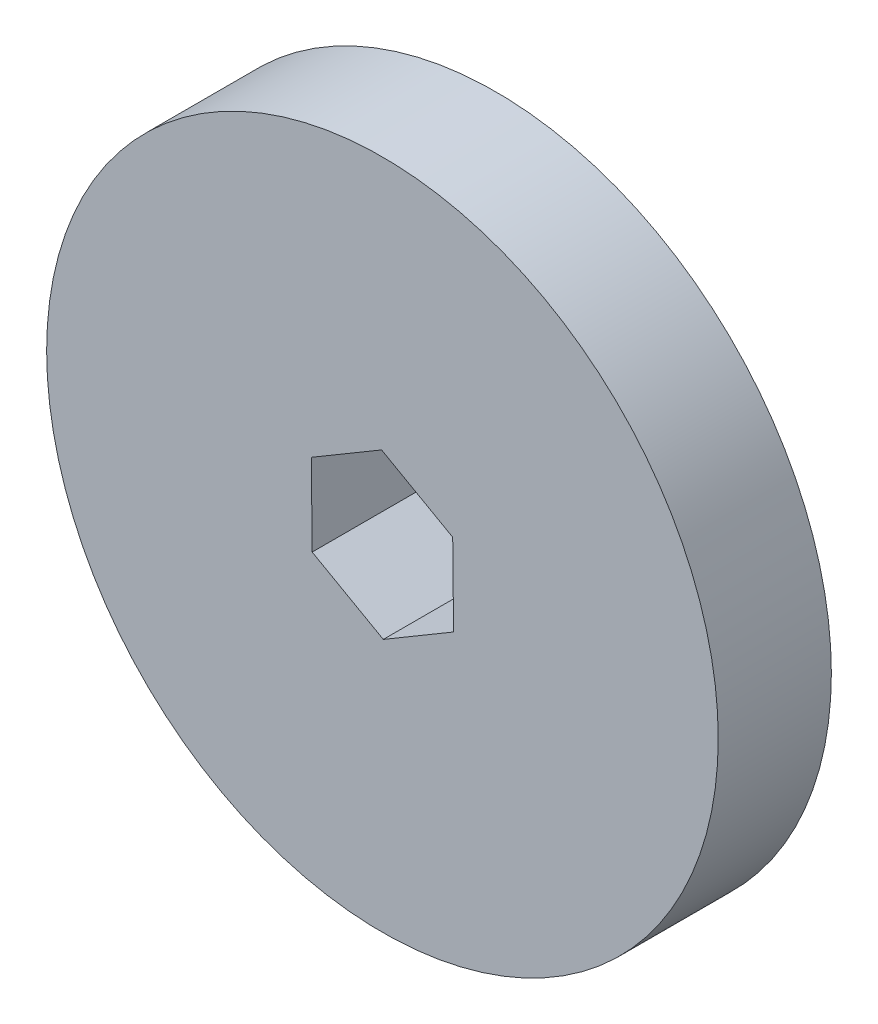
ISO-10303-21;
HEADER;
FILE_DESCRIPTION(('STEP AP214'),'2;1');
FILE_NAME('part.step','',(''),(''),'','','');
FILE_SCHEMA(('AUTOMOTIVE_DESIGN { 1 0 10303 214 1 1 1 1 }'));
ENDSEC;
DATA;
#1=APPLICATION_CONTEXT('core data for automotive mechanical design processes');
#2=APPLICATION_PROTOCOL_DEFINITION('international standard','automotive_design',2000,#1);
#3=PRODUCT_CONTEXT('',#1,'mechanical');
#4=PRODUCT('Part','Part','',(#3));
#5=PRODUCT_RELATED_PRODUCT_CATEGORY('part','',(#4));
#6=PRODUCT_DEFINITION_FORMATION('','',#4);
#7=PRODUCT_DEFINITION_CONTEXT('part definition',#1,'design');
#8=PRODUCT_DEFINITION('design','',#6,#7);
#9=PRODUCT_DEFINITION_SHAPE('','',#8);
#10=(LENGTH_UNIT() NAMED_UNIT(*) SI_UNIT(.MILLI.,.METRE.));
#11=(NAMED_UNIT(*) PLANE_ANGLE_UNIT() SI_UNIT($,.RADIAN.));
#12=(NAMED_UNIT(*) SI_UNIT($,.STERADIAN.) SOLID_ANGLE_UNIT());
#13=UNCERTAINTY_MEASURE_WITH_UNIT(LENGTH_MEASURE(1.E-05),#10,'distance_accuracy_value','');
#14=(GEOMETRIC_REPRESENTATION_CONTEXT(3) GLOBAL_UNCERTAINTY_ASSIGNED_CONTEXT((#13)) GLOBAL_UNIT_ASSIGNED_CONTEXT((#10,
#11,#12)) REPRESENTATION_CONTEXT('',''));
#15=CARTESIAN_POINT('',(0.,0.,0.));
#16=DIRECTION('',(0.,0.,1.));
#17=DIRECTION('',(1.,0.,0.));
#18=AXIS2_PLACEMENT_3D('',#15,#16,#17);
#19=CARTESIAN_POINT('',(0.,0.,10.16));
#20=DIRECTION('',(0.,0.,-1.));
#21=DIRECTION('',(-1.,0.,0.));
#22=AXIS2_PLACEMENT_3D('',#19,#20,#21);
#23=CYLINDRICAL_SURFACE('',#22,30.1625);
#24=CARTESIAN_POINT('',(0.,0.,10.16));
#25=DIRECTION('',(0.,0.,1.));
#26=DIRECTION('',(1.,0.,0.));
#27=AXIS2_PLACEMENT_3D('',#24,#25,#26);
#28=CIRCLE('',#27,30.1625);
#29=CARTESIAN_POINT('',(30.1625,0.,10.16));
#30=VERTEX_POINT('',#29);
#31=EDGE_CURVE('E11',#30,#30,#28,.T.);
#32=ORIENTED_EDGE('',*,*,#31,.F.);
#33=EDGE_LOOP('',(#32));
#34=FACE_BOUND('',#33,.T.);
#35=CARTESIAN_POINT('',(0.,0.,0.));
#36=DIRECTION('',(0.,0.,1.));
#37=DIRECTION('',(1.,0.,0.));
#38=AXIS2_PLACEMENT_3D('',#35,#36,#37);
#39=CIRCLE('',#38,30.1625);
#40=CARTESIAN_POINT('',(30.1625,0.,0.));
#41=VERTEX_POINT('',#40);
#42=EDGE_CURVE('E39',#41,#41,#39,.T.);
#43=ORIENTED_EDGE('',*,*,#42,.T.);
#44=EDGE_LOOP('',(#43));
#45=FACE_BOUND('',#44,.T.);
#46=ADVANCED_FACE('F36',(#34,#45),#23,.T.);
#47=CARTESIAN_POINT('',(0.,0.,10.16));
#48=DIRECTION('',(0.,0.,1.));
#49=DIRECTION('',(1.,0.,0.));
#50=AXIS2_PLACEMENT_3D('',#47,#48,#49);
#51=PLANE('',#50);
#52=DIRECTION('',(-0.0105495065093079,0.999944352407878,0.));
#53=VECTOR('',#52,1.);
#54=CARTESIAN_POINT('',(6.38832296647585,-3.59898082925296,10.16));
#55=LINE('',#54,#53);
#56=CARTESIAN_POINT('',(6.38832296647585,-3.59898082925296,10.16));
#57=VERTEX_POINT('',#56);
#58=CARTESIAN_POINT('',(6.31097030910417,3.73295956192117,10.16));
#59=VERTEX_POINT('',#58);
#60=EDGE_CURVE('E50',#57,#59,#55,.T.);
#61=ORIENTED_EDGE('',*,*,#60,.F.);
#62=DIRECTION('',(0.860702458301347,0.509108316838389,0.));
#63=VECTOR('',#62,1.);
#64=CARTESIAN_POINT('',(0.0773526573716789,-7.33194039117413,10.16));
#65=LINE('',#64,#63);
#66=CARTESIAN_POINT('',(0.0773526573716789,-7.33194039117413,10.16));
#67=VERTEX_POINT('',#66);
#68=EDGE_CURVE('E107',#67,#57,#65,.T.);
#69=ORIENTED_EDGE('',*,*,#68,.F.);
#70=DIRECTION('',(0.871251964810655,-0.490836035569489,0.));
#71=VECTOR('',#70,1.);
#72=CARTESIAN_POINT('',(-6.31097030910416,-3.73295956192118,10.16));
#73=LINE('',#72,#71);
#74=CARTESIAN_POINT('',(-6.31097030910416,-3.73295956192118,10.16));
#75=VERTEX_POINT('',#74);
#76=EDGE_CURVE('E110',#75,#67,#73,.T.);
#77=ORIENTED_EDGE('',*,*,#76,.F.);
#78=DIRECTION('',(0.0105495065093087,-0.999944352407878,0.));
#79=VECTOR('',#78,1.);
#80=CARTESIAN_POINT('',(-6.38832296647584,3.59898082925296,10.16));
#81=LINE('',#80,#79);
#82=CARTESIAN_POINT('',(-6.38832296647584,3.59898082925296,10.16));
#83=VERTEX_POINT('',#82);
#84=EDGE_CURVE('E126',#83,#75,#81,.T.);
#85=ORIENTED_EDGE('',*,*,#84,.F.);
#86=DIRECTION('',(-0.860702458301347,-0.509108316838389,0.));
#87=VECTOR('',#86,1.);
#88=CARTESIAN_POINT('',(-0.0773526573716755,7.33194039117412,10.16));
#89=LINE('',#88,#87);
#90=CARTESIAN_POINT('',(-0.0773526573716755,7.33194039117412,10.16));
#91=VERTEX_POINT('',#90);
#92=EDGE_CURVE('E123',#91,#83,#89,.T.);
#93=ORIENTED_EDGE('',*,*,#92,.F.);
#94=DIRECTION('',(-0.871251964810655,0.490836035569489,0.));
#95=VECTOR('',#94,1.);
#96=CARTESIAN_POINT('',(6.31097030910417,3.73295956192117,10.16));
#97=LINE('',#96,#95);
#98=EDGE_CURVE('E121',#59,#91,#97,.T.);
#99=ORIENTED_EDGE('',*,*,#98,.F.);
#100=EDGE_LOOP('',(#61,#69,#77,#85,#93,#99));
#101=FACE_BOUND('',#100,.T.);
#102=ORIENTED_EDGE('',*,*,#31,.T.);
#103=EDGE_LOOP('',(#102));
#104=FACE_BOUND('',#103,.T.);
#105=ADVANCED_FACE('F143',(#101,#104),#51,.T.);
#106=CARTESIAN_POINT('',(0.,0.,0.));
#107=DIRECTION('',(0.,0.,1.));
#108=DIRECTION('',(1.,0.,0.));
#109=AXIS2_PLACEMENT_3D('',#106,#107,#108);
#110=PLANE('',#109);
#111=DIRECTION('',(0.860702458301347,0.509108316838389,0.));
#112=VECTOR('',#111,1.);
#113=CARTESIAN_POINT('',(0.0773526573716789,-7.33194039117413,0.));
#114=LINE('',#113,#112);
#115=CARTESIAN_POINT('',(0.0773526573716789,-7.33194039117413,0.));
#116=VERTEX_POINT('',#115);
#117=CARTESIAN_POINT('',(6.38832296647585,-3.59898082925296,0.));
#118=VERTEX_POINT('',#117);
#119=EDGE_CURVE('E96',#116,#118,#114,.T.);
#120=ORIENTED_EDGE('',*,*,#119,.T.);
#121=DIRECTION('',(-0.0105495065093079,0.999944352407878,0.));
#122=VECTOR('',#121,1.);
#123=CARTESIAN_POINT('',(6.38832296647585,-3.59898082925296,0.));
#124=LINE('',#123,#122);
#125=CARTESIAN_POINT('',(6.31097030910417,3.73295956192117,0.));
#126=VERTEX_POINT('',#125);
#127=EDGE_CURVE('E90',#118,#126,#124,.T.);
#128=ORIENTED_EDGE('',*,*,#127,.T.);
#129=DIRECTION('',(-0.871251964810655,0.490836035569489,0.));
#130=VECTOR('',#129,1.);
#131=CARTESIAN_POINT('',(6.31097030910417,3.73295956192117,0.));
#132=LINE('',#131,#130);
#133=CARTESIAN_POINT('',(-0.0773526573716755,7.33194039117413,0.));
#134=VERTEX_POINT('',#133);
#135=EDGE_CURVE('E99',#126,#134,#132,.T.);
#136=ORIENTED_EDGE('',*,*,#135,.T.);
#137=DIRECTION('',(-0.860702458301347,-0.509108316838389,0.));
#138=VECTOR('',#137,1.);
#139=CARTESIAN_POINT('',(-0.0773526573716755,7.33194039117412,0.));
#140=LINE('',#139,#138);
#141=CARTESIAN_POINT('',(-6.38832296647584,3.59898082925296,0.));
#142=VERTEX_POINT('',#141);
#143=EDGE_CURVE('E58',#134,#142,#140,.T.);
#144=ORIENTED_EDGE('',*,*,#143,.T.);
#145=DIRECTION('',(0.0105495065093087,-0.999944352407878,0.));
#146=VECTOR('',#145,1.);
#147=CARTESIAN_POINT('',(-6.38832296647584,3.59898082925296,0.));
#148=LINE('',#147,#146);
#149=CARTESIAN_POINT('',(-6.31097030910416,-3.73295956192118,0.));
#150=VERTEX_POINT('',#149);
#151=EDGE_CURVE('E114',#142,#150,#148,.T.);
#152=ORIENTED_EDGE('',*,*,#151,.T.);
#153=DIRECTION('',(0.871251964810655,-0.490836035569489,0.));
#154=VECTOR('',#153,1.);
#155=CARTESIAN_POINT('',(-6.31097030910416,-3.73295956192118,0.));
#156=LINE('',#155,#154);
#157=EDGE_CURVE('E117',#150,#116,#156,.T.);
#158=ORIENTED_EDGE('',*,*,#157,.T.);
#159=EDGE_LOOP('',(#120,#128,#136,#144,#152,#158));
#160=FACE_BOUND('',#159,.T.);
#161=ORIENTED_EDGE('',*,*,#42,.F.);
#162=EDGE_LOOP('',(#161));
#163=FACE_BOUND('',#162,.T.);
#164=ADVANCED_FACE('F103',(#160,#163),#110,.F.);
#165=CARTESIAN_POINT('',(6.38832296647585,-3.59898082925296,0.));
#166=DIRECTION('',(0.999944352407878,0.0105495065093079,0.));
#167=DIRECTION('',(-0.0105495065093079,0.999944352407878,0.));
#168=AXIS2_PLACEMENT_3D('',#165,#166,#167);
#169=PLANE('',#168);
#170=ORIENTED_EDGE('',*,*,#60,.T.);
#171=DIRECTION('',(0.,0.,1.));
#172=VECTOR('',#171,1.);
#173=CARTESIAN_POINT('',(6.31097030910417,3.73295956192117,0.));
#174=LINE('',#173,#172);
#175=EDGE_CURVE('E86',#126,#59,#174,.T.);
#176=ORIENTED_EDGE('',*,*,#175,.F.);
#177=ORIENTED_EDGE('',*,*,#127,.F.);
#178=DIRECTION('',(0.,0.,1.));
#179=VECTOR('',#178,1.);
#180=CARTESIAN_POINT('',(6.38832296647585,-3.59898082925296,0.));
#181=LINE('',#180,#179);
#182=EDGE_CURVE('E131',#118,#57,#181,.T.);
#183=ORIENTED_EDGE('',*,*,#182,.T.);
#184=EDGE_LOOP('',(#170,#176,#177,#183));
#185=FACE_BOUND('',#184,.T.);
#186=ADVANCED_FACE('F88',(#185),#169,.F.);
#187=CARTESIAN_POINT('',(0.0773526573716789,-7.33194039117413,0.));
#188=DIRECTION('',(0.509108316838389,-0.860702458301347,0.));
#189=DIRECTION('',(0.860702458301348,0.509108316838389,0.));
#190=AXIS2_PLACEMENT_3D('',#187,#188,#189);
#191=PLANE('',#190);
#192=ORIENTED_EDGE('',*,*,#68,.T.);
#193=ORIENTED_EDGE('',*,*,#182,.F.);
#194=ORIENTED_EDGE('',*,*,#119,.F.);
#195=DIRECTION('',(0.,0.,1.));
#196=VECTOR('',#195,1.);
#197=CARTESIAN_POINT('',(0.0773526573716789,-7.33194039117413,0.));
#198=LINE('',#197,#196);
#199=EDGE_CURVE('E133',#116,#67,#198,.T.);
#200=ORIENTED_EDGE('',*,*,#199,.T.);
#201=EDGE_LOOP('',(#192,#193,#194,#200));
#202=FACE_BOUND('',#201,.T.);
#203=ADVANCED_FACE('F154',(#202),#191,.F.);
#204=CARTESIAN_POINT('',(-6.31097030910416,-3.73295956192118,0.));
#205=DIRECTION('',(-0.490836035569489,-0.871251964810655,0.));
#206=DIRECTION('',(0.871251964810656,-0.490836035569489,0.));
#207=AXIS2_PLACEMENT_3D('',#204,#205,#206);
#208=PLANE('',#207);
#209=ORIENTED_EDGE('',*,*,#76,.T.);
#210=ORIENTED_EDGE('',*,*,#199,.F.);
#211=ORIENTED_EDGE('',*,*,#157,.F.);
#212=DIRECTION('',(0.,0.,1.));
#213=VECTOR('',#212,1.);
#214=CARTESIAN_POINT('',(-6.31097030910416,-3.73295956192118,0.));
#215=LINE('',#214,#213);
#216=EDGE_CURVE('E135',#150,#75,#215,.T.);
#217=ORIENTED_EDGE('',*,*,#216,.T.);
#218=EDGE_LOOP('',(#209,#210,#211,#217));
#219=FACE_BOUND('',#218,.T.);
#220=ADVANCED_FACE('F152',(#219),#208,.F.);
#221=CARTESIAN_POINT('',(-6.38832296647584,3.59898082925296,0.));
#222=DIRECTION('',(-0.999944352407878,-0.0105495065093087,0.));
#223=DIRECTION('',(0.0105495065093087,-0.999944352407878,0.));
#224=AXIS2_PLACEMENT_3D('',#221,#222,#223);
#225=PLANE('',#224);
#226=ORIENTED_EDGE('',*,*,#84,.T.);
#227=ORIENTED_EDGE('',*,*,#216,.F.);
#228=ORIENTED_EDGE('',*,*,#151,.F.);
#229=DIRECTION('',(0.,0.,1.));
#230=VECTOR('',#229,1.);
#231=CARTESIAN_POINT('',(-6.38832296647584,3.59898082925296,0.));
#232=LINE('',#231,#230);
#233=EDGE_CURVE('E137',#142,#83,#232,.T.);
#234=ORIENTED_EDGE('',*,*,#233,.T.);
#235=EDGE_LOOP('',(#226,#227,#228,#234));
#236=FACE_BOUND('',#235,.T.);
#237=ADVANCED_FACE('F148',(#236),#225,.F.);
#238=CARTESIAN_POINT('',(-0.0773526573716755,7.33194039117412,0.));
#239=DIRECTION('',(-0.509108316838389,0.860702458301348,0.));
#240=DIRECTION('',(-0.860702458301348,-0.509108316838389,0.));
#241=AXIS2_PLACEMENT_3D('',#238,#239,#240);
#242=PLANE('',#241);
#243=ORIENTED_EDGE('',*,*,#92,.T.);
#244=ORIENTED_EDGE('',*,*,#233,.F.);
#245=ORIENTED_EDGE('',*,*,#143,.F.);
#246=DIRECTION('',(0.,0.,1.));
#247=VECTOR('',#246,1.);
#248=CARTESIAN_POINT('',(-0.0773526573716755,7.33194039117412,0.));
#249=LINE('',#248,#247);
#250=EDGE_CURVE('E95',#134,#91,#249,.T.);
#251=ORIENTED_EDGE('',*,*,#250,.T.);
#252=EDGE_LOOP('',(#243,#244,#245,#251));
#253=FACE_BOUND('',#252,.T.);
#254=ADVANCED_FACE('F139',(#253),#242,.F.);
#255=CARTESIAN_POINT('',(6.31097030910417,3.73295956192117,0.));
#256=DIRECTION('',(0.490836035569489,0.871251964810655,0.));
#257=DIRECTION('',(-0.871251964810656,0.490836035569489,0.));
#258=AXIS2_PLACEMENT_3D('',#255,#256,#257);
#259=PLANE('',#258);
#260=ORIENTED_EDGE('',*,*,#98,.T.);
#261=ORIENTED_EDGE('',*,*,#250,.F.);
#262=ORIENTED_EDGE('',*,*,#135,.F.);
#263=ORIENTED_EDGE('',*,*,#175,.T.);
#264=EDGE_LOOP('',(#260,#261,#262,#263));
#265=FACE_BOUND('',#264,.T.);
#266=ADVANCED_FACE('F100',(#265),#259,.F.);
#267=CLOSED_SHELL('',(#46,#105,#164,#186,#203,#220,#237,#254,#266));
#268=MANIFOLD_SOLID_BREP('B2',#267);
#269=ADVANCED_BREP_SHAPE_REPRESENTATION('',(#18,#268),#14);
#270=SHAPE_DEFINITION_REPRESENTATION(#9,#269);
ENDSEC;
END-ISO-10303-21;
